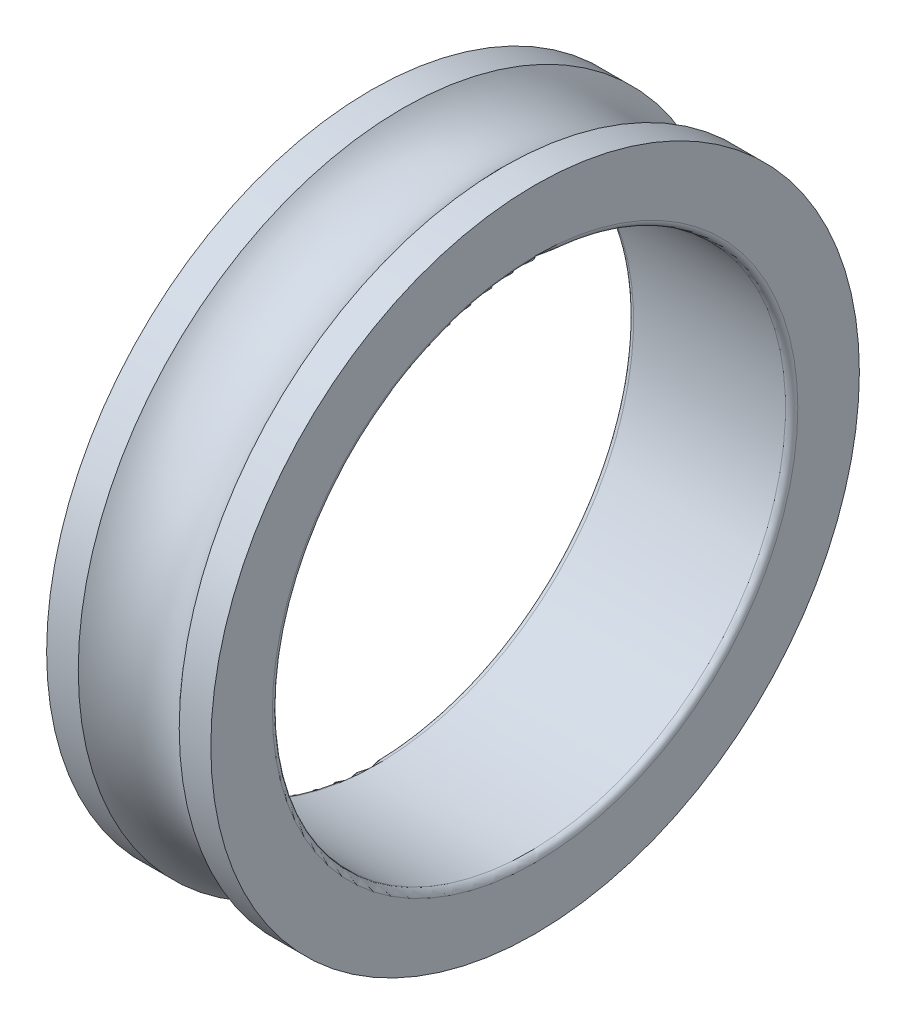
from build123d import *


with BuildPart() as part:
    # Esquisse1 → Base-R_volution (revolve)
    with BuildSketch(Plane(origin=(0, 0, 0), x_dir=(1, 0, 0), z_dir=(0, 1, 0)), mode=Mode.PRIVATE) as base_r_volution_sk:
        with BuildLine():
            Line((0, 15.8), (0, 12.8))
            ThreePointArc((0, 12.8), (0.087867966, 12.587867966), (0.3, 12.5))
            Line((0.3, 12.5), (7.7, 12.5))
            ThreePointArc((7.7, 12.5), (7.912132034, 12.587867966), (8, 12.8))
            Line((8, 12.8), (8, 15.8))
            Line((8, 15.8), (6.459674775, 15.8))
            ThreePointArc((6.459674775, 15.8), (4, 14.7), (1.540325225, 15.8))
            Line((1.540325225, 15.8), (0, 15.8))
        make_face()
    revolve(base_r_volution_sk.sketch.rotate(Axis((0, 0, 0), (1, 0, 0)), 180), axis=Axis((0, 0, 0), (1, 0, 0)))


solid = part.part
